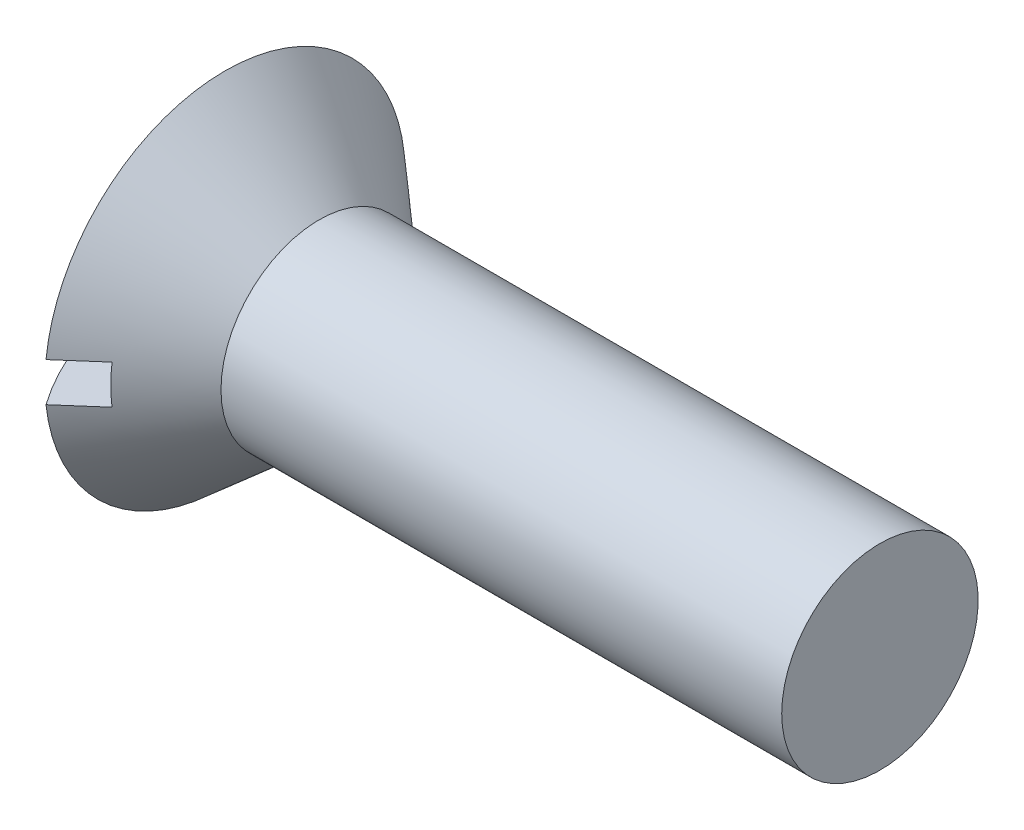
from build123d import *

# Parameters (mm, degrees)
SKETCH2_W         = 34.925
SKETCH2_H         = 3.7846
SLOT_DEPTH        = 8.9662
CIRPATTERN1_COUNT = 2
CIRPATTERN1_ANGLE = 90


with BuildPart() as part:
    # BodySke → Base-Revolve (revolve)
    with BuildSketch(Plane.XY, mode=Mode.PRIVATE) as base_revolve_sk:
        with BuildLine():
            Line((0, 0), (69.050150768, 0))
            Line((69.050150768, 0), (69.050150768, 9.525))
            Line((69.050150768, 9.525), (14.6812, 9.525))
            Line((14.6812, 9.525), (5.550150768, 17.4625))
            ThreePointArc((5.550150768, 17.4625), (1.420913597, 9.161646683), (0, 0))
        make_face()
    revolve(base_revolve_sk.sketch.rotate(Axis((-15.875, 0, 0), (1, 0, 0)), 90), axis=Axis((-15.875, 0, 0), (1, 0, 0)))

    # Sketch2 → Slot (cut)
    with BuildSketch(Plane(origin=(0, 0, 0), x_dir=(0, 0, -1), z_dir=(1, 0, 0))):
        Rectangle(SKETCH2_W, SKETCH2_H)
    extrude(amount=SLOT_DEPTH, mode=Mode.SUBTRACT)

    # Sketch3 → Cross section 0
    with BuildSketch(Plane(origin=(0, 0, 0), x_dir=(0, 0, -1), z_dir=(1, 0, 0))):
        with BuildLine():
            Line((1.3208, -8.3312), (-1.3208, -8.3312))
            Line((-1.3208, -8.3312), (-1.3208, 8.3312))
            Line((-1.3208, 8.3312), (1.3208, 8.3312))
            Line((1.3208, 8.3312), (1.3208, -8.3312))
        make_face()
    # Sketch4 → Cross section 1
    with BuildSketch(Plane(origin=(10.16, 0, 0), x_dir=(0, 0, -1), z_dir=(1, 0, 0))):
        with BuildLine():
            Line((0.6604, -0.6604), (-0.6604, -0.6604))
            Line((-0.6604, -0.6604), (-0.6604, 0.6604))
            Line((-0.6604, 0.6604), (0.6604, 0.6604))
            Line((0.6604, 0.6604), (0.6604, -0.6604))
        make_face()
    cross = loft(mode=Mode.SUBTRACT)

    # CirPattern1: Cross ×2 about axis
    cirpattern1_axis = Axis((0, 0, 0), (1, 0, 0))
    for i in range(1, CIRPATTERN1_COUNT):
        add(cross.rotate(cirpattern1_axis, i * CIRPATTERN1_ANGLE / (CIRPATTERN1_COUNT - 1)), mode=Mode.SUBTRACT)


solid = part.part
